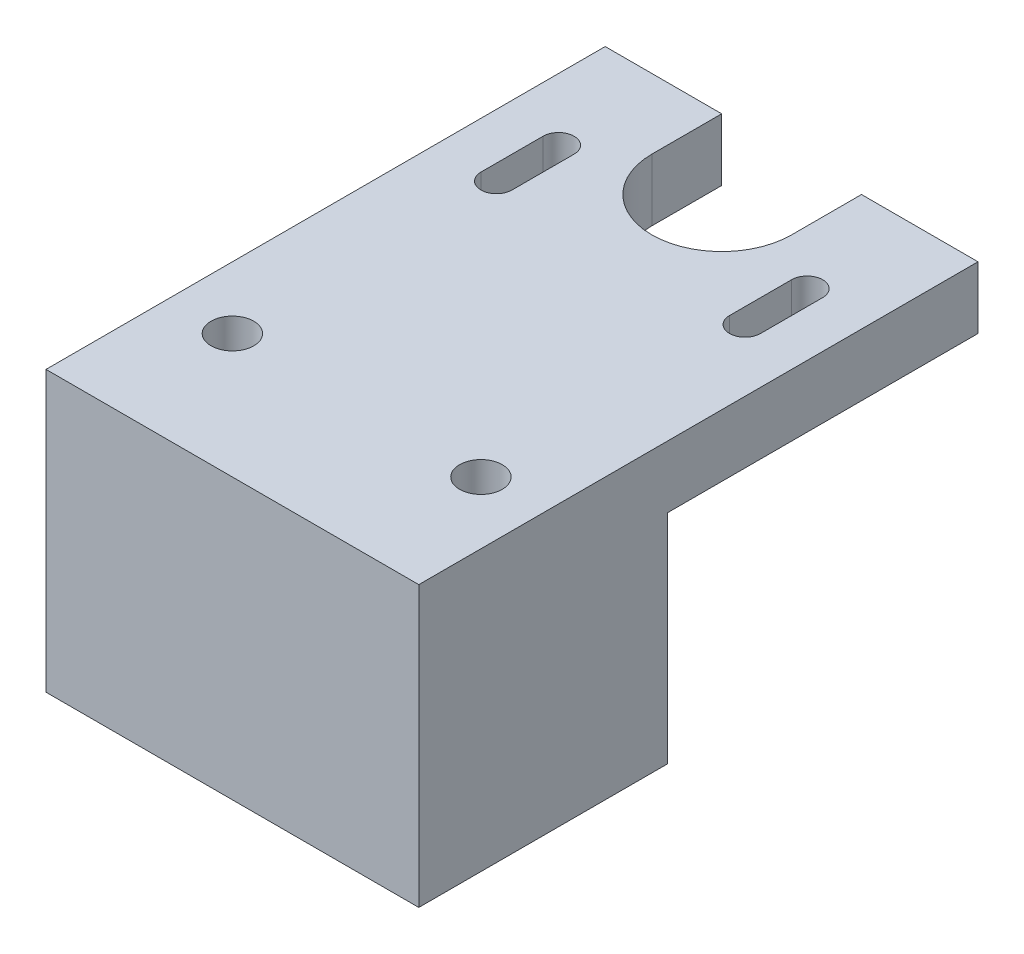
from build123d import *

# Parameters (mm, degrees)
BOSS_EXTRUDE1_DEPTH = 38.1
SKETCH3_R           = 4.3688
CUT_EXTRUDE1_DEPTH  = 134.35


with BuildPart() as part:
    # Sketch2 → Boss-Extrude1 (new, symmetric)
    with BuildSketch(Plane(origin=(0, 0, 0), x_dir=(0, 0, -1), z_dir=(1, 0, 0))):
        Polygon((0, 0), (0, 57.15), (114.3, 57.15), (114.3, 44.45), (50.8, 44.45), (50.8, 0), align=None)
    extrude(amount=BOSS_EXTRUDE1_DEPTH, both=True)

    # Sketch3 → Cut-Extrude1 (cut, through all)
    with BuildSketch(Plane(origin=(0, 57.15, 0), x_dir=(1, 0, 0), z_dir=(0, 1, 0))):
        with Locations(Location((-25.4, 25.4, 0), (0, 0, 270))):
            Circle(SKETCH3_R)
        with Locations(Location((25.4, 25.4, 0), (0, 0, 90))):
            Circle(SKETCH3_R)
        with BuildLine():
            Line((-14.2875, 114.3), (-14.2875, 100.0125))
            ThreePointArc((-14.2875, 100.0125), (0, 85.725), (14.2875, 100.0125))
            Line((14.2875, 100.0125), (14.2875, 114.3))
            Line((14.2875, 114.3), (-14.2875, 114.3))
        make_face()
        with BuildLine():
            Line((28.575, 92.075), (28.575, 79.375))
            ThreePointArc((28.575, 79.375), (25.4, 76.2), (22.225, 79.375))
            Line((22.225, 79.375), (22.225, 92.075))
            ThreePointArc((22.225, 92.075), (25.4, 95.25), (28.575, 92.075))
        make_face()
        with BuildLine():
            Line((-28.575, 92.075), (-28.575, 79.375))
            ThreePointArc((-28.575, 79.375), (-25.4, 76.2), (-22.225, 79.375))
            Line((-22.225, 79.375), (-22.225, 92.075))
            ThreePointArc((-22.225, 92.075), (-25.4, 95.25), (-28.575, 92.075))
        make_face()
    extrude(amount=-CUT_EXTRUDE1_DEPTH, mode=Mode.SUBTRACT)


solid = part.part
